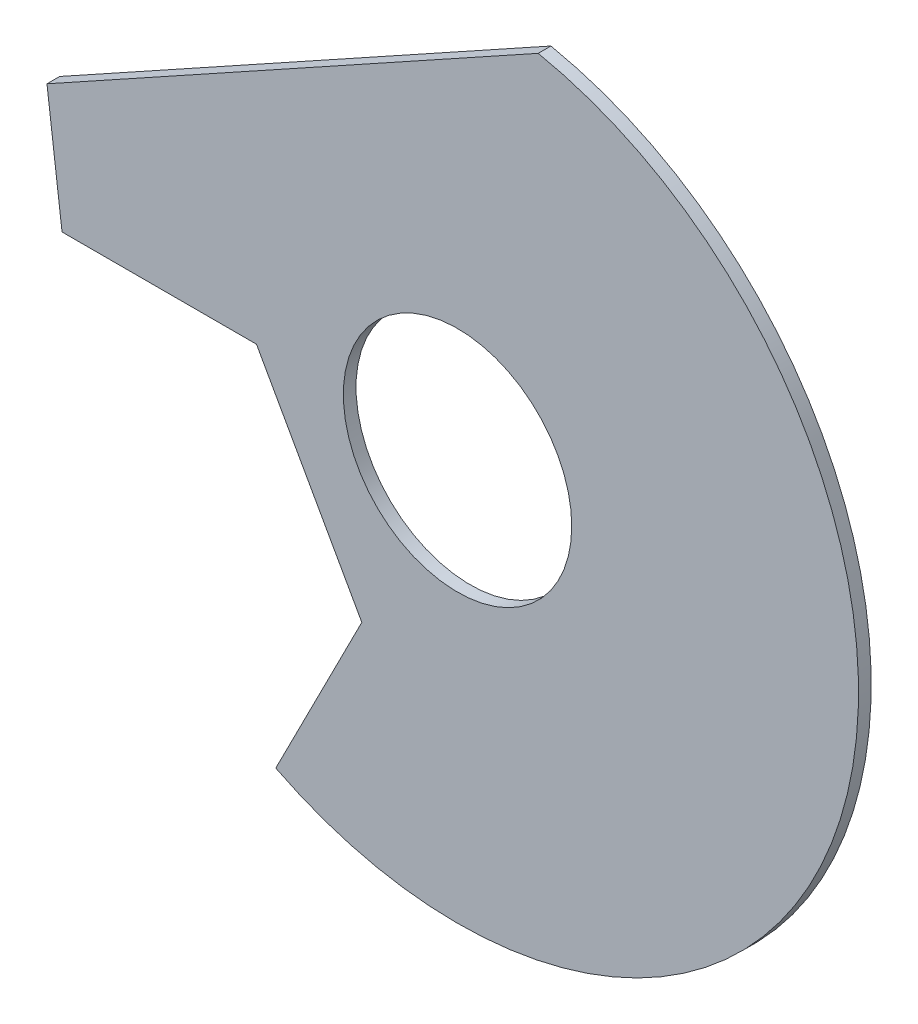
from build123d import *

# Parameters (mm, degrees)
BOSS_EXTRU_1_DEPTH      = 0.5
ESQUISSE2_R             = 4.5
ENL_V_MAT_EXTRU_1_DEPTH = 10


with BuildPart() as part:
    # Esquisse1 → Boss.-Extru.1 (new body)
    with BuildSketch(Plane.XY):
        with BuildLine():
            Line((42.178843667, 58.976916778), (22.823099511, 48.259460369))
            Line((22.823099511, 48.259460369), (23.416694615, 43.5))
            Line((23.416694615, 43.5), (31.07869054, 43.5))
            Line((31.07869054, 43.5), (35.228703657, 36.084037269))
            Line((35.228703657, 36.084037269), (31.837996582, 29.416473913))
            ThreePointArc((31.837996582, 29.416473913), (53.913796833, 38.282849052), (42.178843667, 58.976916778))
        make_face()
    extrude(amount=BOSS_EXTRU_1_DEPTH)

    # Esquisse2 → Enl_v. mat.-Extru.1 (cut)
    with BuildSketch(Plane.XY.offset(0.5)):
        with Locations((39, 43.5)):
            Circle(ESQUISSE2_R)
    extrude(amount=-ENL_V_MAT_EXTRU_1_DEPTH, mode=Mode.SUBTRACT)


solid = part.part
